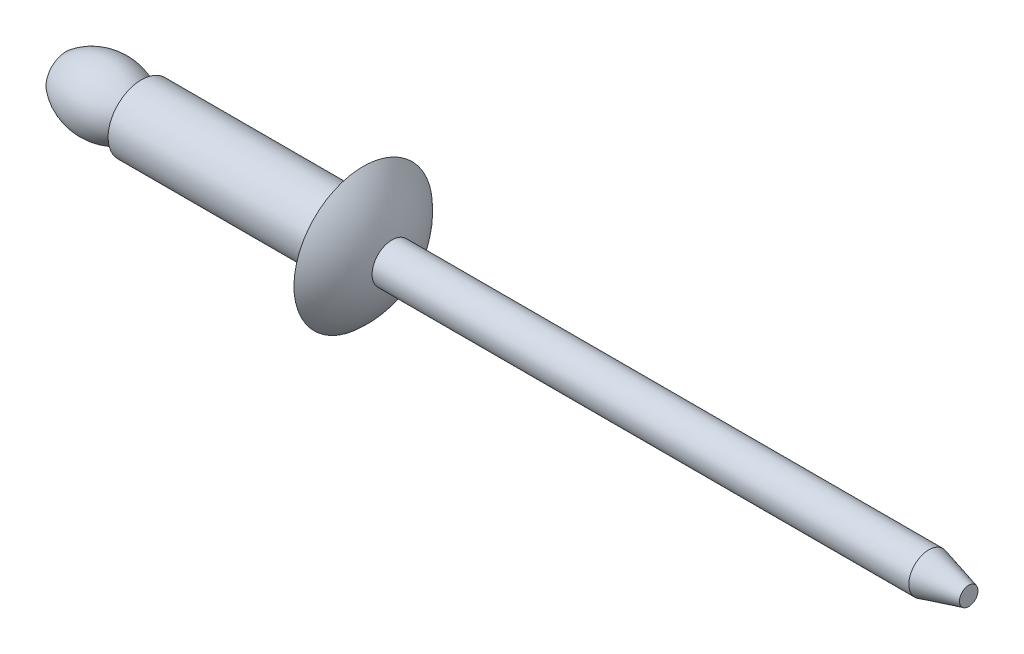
from build123d import *

# Parameters (mm, degrees)
FILLET1_R      = 0.5
CHAMFER1_SIZE  = 1.8
CHAMFER1_SIZE2 = 0.482308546


with BuildPart() as part:
    # Sketch1 → Base-Revolve (revolve)
    with BuildSketch(Plane(origin=(-11.603452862, 14.723452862, 0), x_dir=(0, -1, 0), z_dir=(0, 0, 1)), mode=Mode.PRIVATE) as base_revolve_sk:
        with BuildLine():
            Line((15.623452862, 15.003452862), (16.223452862, 15.003452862))
            Line((16.223452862, 15.003452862), (16.223452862, 25.003452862))
            Line((16.223452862, 25.003452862), (17.843452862, 25.003452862))
            ThreePointArc((17.843452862, 25.003452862), (16.836228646, 25.829648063), (15.623452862, 26.305330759))
            Line((15.623452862, 26.305330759), (15.623452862, 52.305330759))
            Line((15.623452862, 52.305330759), (14.723452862, 52.305330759))
            Line((14.723452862, 52.305330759), (14.723452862, 11.603452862))
            Line((14.723452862, 11.603452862), (15.623452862, 11.603452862))
            ThreePointArc((15.623452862, 11.603452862), (16.223452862, 13.303452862), (15.623452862, 15.003452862))
        make_face()
    revolve(base_revolve_sk.sketch.rotate(Axis((22.734231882, 0, 0), (-1, 0, 0)), 180), axis=Axis((22.734231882, 0, 0), (-1, 0, 0)))

    # Fillet1
    fillet1_edges = [part.edges().sort_by_distance(p)[0] for p in [
        (13.4, -1.5, 0),
    ]]
    fillet(fillet1_edges, radius=FILLET1_R)

    # Chamfer1
    chamfer1_edges = [part.edges().sort_by_distance(p)[0] for p in [
        (40.701877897, -0.9, 0),
    ]]
    chamfer1_side = [part.faces().sort_by_distance(p)[0] for p in [
        (27.701877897, -0.9, 0),
    ]]
    chamfer(chamfer1_edges, length=CHAMFER1_SIZE, length2=CHAMFER1_SIZE2, reference=chamfer1_side[0])


solid = part.part
